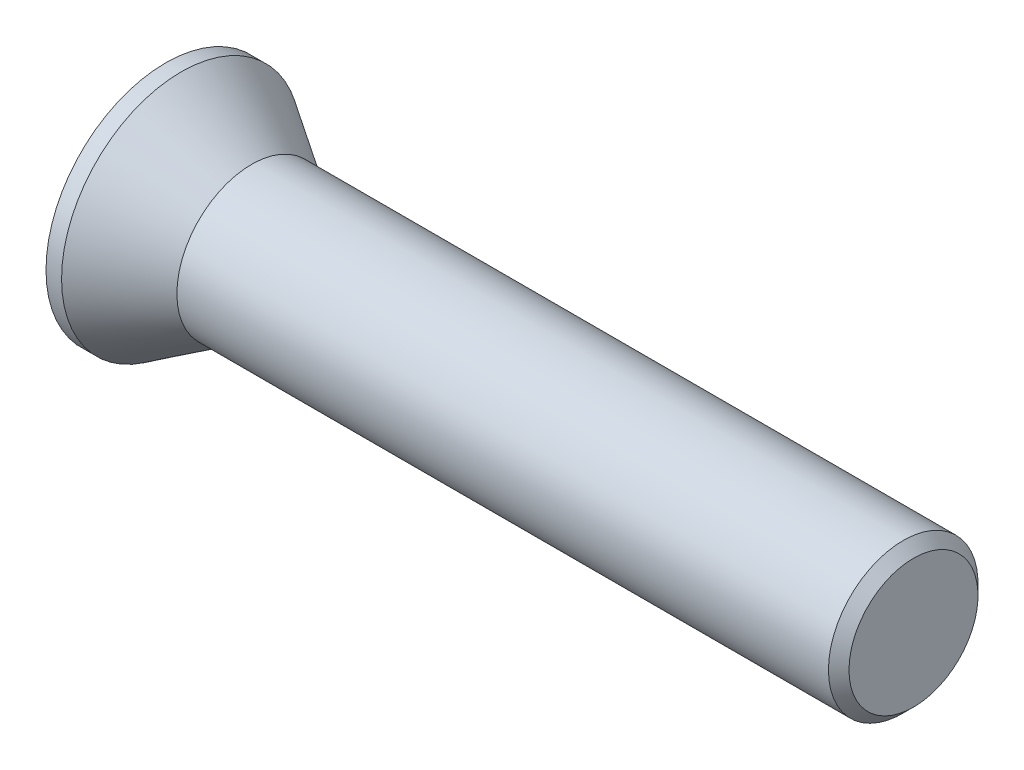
ISO-10303-21;
HEADER;
FILE_DESCRIPTION(('STEP AP214'),'2;1');
FILE_NAME('part.step','',(''),(''),'','','');
FILE_SCHEMA(('AUTOMOTIVE_DESIGN { 1 0 10303 214 1 1 1 1 }'));
ENDSEC;
DATA;
#1=APPLICATION_CONTEXT('core data for automotive mechanical design processes');
#2=APPLICATION_PROTOCOL_DEFINITION('international standard','automotive_design',2000,#1);
#3=PRODUCT_CONTEXT('',#1,'mechanical');
#4=PRODUCT('Part','Part','',(#3));
#5=PRODUCT_RELATED_PRODUCT_CATEGORY('part','',(#4));
#6=PRODUCT_DEFINITION_FORMATION('','',#4);
#7=PRODUCT_DEFINITION_CONTEXT('part definition',#1,'design');
#8=PRODUCT_DEFINITION('design','',#6,#7);
#9=PRODUCT_DEFINITION_SHAPE('','',#8);
#10=(LENGTH_UNIT() NAMED_UNIT(*) SI_UNIT(.MILLI.,.METRE.));
#11=(NAMED_UNIT(*) PLANE_ANGLE_UNIT() SI_UNIT($,.RADIAN.));
#12=(NAMED_UNIT(*) SI_UNIT($,.STERADIAN.) SOLID_ANGLE_UNIT());
#13=UNCERTAINTY_MEASURE_WITH_UNIT(LENGTH_MEASURE(1.E-05),#10,'distance_accuracy_value','');
#14=(GEOMETRIC_REPRESENTATION_CONTEXT(3) GLOBAL_UNCERTAINTY_ASSIGNED_CONTEXT((#13)) GLOBAL_UNIT_ASSIGNED_CONTEXT((#10,
#11,#12)) REPRESENTATION_CONTEXT('',''));
#15=CARTESIAN_POINT('',(0.,0.,0.));
#16=DIRECTION('',(0.,0.,1.));
#17=DIRECTION('',(1.,0.,0.));
#18=AXIS2_PLACEMENT_3D('',#15,#16,#17);
#19=CARTESIAN_POINT('',(0.,0.,0.));
#20=DIRECTION('',(-1.,0.,0.));
#21=DIRECTION('',(0.,0.,1.));
#22=AXIS2_PLACEMENT_3D('',#19,#20,#21);
#23=PLANE('',#22);
#24=CARTESIAN_POINT('',(0.,0.,0.));
#25=DIRECTION('',(-1.,0.,0.));
#26=DIRECTION('',(0.,0.,1.));
#27=AXIS2_PLACEMENT_3D('',#24,#25,#26);
#28=CIRCLE('',#27,16.);
#29=CARTESIAN_POINT('',(0.,0.,16.));
#30=VERTEX_POINT('',#29);
#31=EDGE_CURVE('E11',#30,#30,#28,.T.);
#32=ORIENTED_EDGE('',*,*,#31,.T.);
#33=EDGE_LOOP('',(#32));
#34=FACE_BOUND('',#33,.T.);
#35=DIRECTION('',(0.,1.,0.));
#36=VECTOR('',#35,1.);
#37=CARTESIAN_POINT('',(0.,-2.5,12.5));
#38=LINE('',#37,#36);
#39=CARTESIAN_POINT('',(0.,-2.5,12.5));
#40=VERTEX_POINT('',#39);
#41=CARTESIAN_POINT('',(0.,2.5,12.5));
#42=VERTEX_POINT('',#41);
#43=EDGE_CURVE('E85',#40,#42,#38,.T.);
#44=ORIENTED_EDGE('',*,*,#43,.F.);
#45=DIRECTION('',(0.,0.,1.));
#46=VECTOR('',#45,1.);
#47=CARTESIAN_POINT('',(0.,-2.5,-12.5));
#48=LINE('',#47,#46);
#49=CARTESIAN_POINT('',(0.,-2.5,-12.5));
#50=VERTEX_POINT('',#49);
#51=EDGE_CURVE('E95',#50,#40,#48,.T.);
#52=ORIENTED_EDGE('',*,*,#51,.F.);
#53=DIRECTION('',(0.,1.,0.));
#54=VECTOR('',#53,1.);
#55=CARTESIAN_POINT('',(0.,-2.5,-12.5));
#56=LINE('',#55,#54);
#57=CARTESIAN_POINT('',(0.,2.5,-12.5));
#58=VERTEX_POINT('',#57);
#59=EDGE_CURVE('E55',#50,#58,#56,.T.);
#60=ORIENTED_EDGE('',*,*,#59,.T.);
#61=DIRECTION('',(0.,0.,1.));
#62=VECTOR('',#61,1.);
#63=CARTESIAN_POINT('',(0.,2.5,-12.5));
#64=LINE('',#63,#62);
#65=EDGE_CURVE('E90',#58,#42,#64,.T.);
#66=ORIENTED_EDGE('',*,*,#65,.T.);
#67=EDGE_LOOP('',(#44,#52,#60,#66));
#68=FACE_BOUND('',#67,.T.);
#69=ADVANCED_FACE('F33',(#34,#68),#23,.T.);
#70=CARTESIAN_POINT('',(0.,0.,0.));
#71=DIRECTION('',(-1.,0.,0.));
#72=DIRECTION('',(0.,0.,1.));
#73=AXIS2_PLACEMENT_3D('',#70,#71,#72);
#74=CYLINDRICAL_SURFACE('',#73,16.);
#75=CARTESIAN_POINT('',(2.08188653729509,0.,0.));
#76=DIRECTION('',(-1.,0.,0.));
#77=DIRECTION('',(0.,0.,1.));
#78=AXIS2_PLACEMENT_3D('',#75,#76,#77);
#79=CIRCLE('',#78,16.);
#80=CARTESIAN_POINT('',(2.08188653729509,0.,16.));
#81=VERTEX_POINT('',#80);
#82=EDGE_CURVE('E40',#81,#81,#79,.T.);
#83=ORIENTED_EDGE('',*,*,#82,.T.);
#84=EDGE_LOOP('',(#83));
#85=FACE_BOUND('',#84,.T.);
#86=ORIENTED_EDGE('',*,*,#31,.F.);
#87=EDGE_LOOP('',(#86));
#88=FACE_BOUND('',#87,.T.);
#89=ADVANCED_FACE('F120',(#85,#88),#74,.T.);
#90=CARTESIAN_POINT('',(2.08188653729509,0.,0.));
#91=DIRECTION('',(-1.,0.,0.));
#92=DIRECTION('',(0.,0.,1.));
#93=AXIS2_PLACEMENT_3D('',#90,#91,#92);
#94=CONICAL_SURFACE('',#93,16.,0.567232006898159);
#95=CARTESIAN_POINT('',(11.5,0.,0.));
#96=DIRECTION('',(-1.,0.,0.));
#97=DIRECTION('',(0.,0.,1.));
#98=AXIS2_PLACEMENT_3D('',#95,#96,#97);
#99=CIRCLE('',#98,10.);
#100=CARTESIAN_POINT('',(11.5,0.,10.));
#101=VERTEX_POINT('',#100);
#102=EDGE_CURVE('E115',#101,#101,#99,.T.);
#103=ORIENTED_EDGE('',*,*,#102,.T.);
#104=EDGE_LOOP('',(#103));
#105=FACE_BOUND('',#104,.T.);
#106=ORIENTED_EDGE('',*,*,#82,.F.);
#107=EDGE_LOOP('',(#106));
#108=FACE_BOUND('',#107,.T.);
#109=ADVANCED_FACE('F123',(#105,#108),#94,.T.);
#110=CARTESIAN_POINT('',(0.,0.,0.));
#111=DIRECTION('',(-1.,0.,0.));
#112=DIRECTION('',(0.,0.,1.));
#113=AXIS2_PLACEMENT_3D('',#110,#111,#112);
#114=CYLINDRICAL_SURFACE('',#113,10.);
#115=CARTESIAN_POINT('',(98.6259999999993,0.,0.));
#116=DIRECTION('',(-1.,0.,0.));
#117=DIRECTION('',(0.,0.,1.));
#118=AXIS2_PLACEMENT_3D('',#115,#116,#117);
#119=CIRCLE('',#118,10.);
#120=CARTESIAN_POINT('',(98.6259999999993,0.,10.));
#121=VERTEX_POINT('',#120);
#122=EDGE_CURVE('E112',#121,#121,#119,.T.);
#123=ORIENTED_EDGE('',*,*,#122,.T.);
#124=EDGE_LOOP('',(#123));
#125=FACE_BOUND('',#124,.T.);
#126=ORIENTED_EDGE('',*,*,#102,.F.);
#127=EDGE_LOOP('',(#126));
#128=FACE_BOUND('',#127,.T.);
#129=ADVANCED_FACE('F125',(#125,#128),#114,.T.);
#130=CARTESIAN_POINT('',(100.,0.,0.));
#131=DIRECTION('',(-1.,0.,0.));
#132=DIRECTION('',(0.,0.,1.));
#133=AXIS2_PLACEMENT_3D('',#130,#131,#132);
#134=CONICAL_SURFACE('',#133,8.626,0.785398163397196);
#135=ORIENTED_EDGE('',*,*,#122,.F.);
#136=EDGE_LOOP('',(#135));
#137=FACE_BOUND('',#136,.T.);
#138=CARTESIAN_POINT('',(100.,0.,0.));
#139=DIRECTION('',(-1.,0.,0.));
#140=DIRECTION('',(0.,0.,1.));
#141=AXIS2_PLACEMENT_3D('',#138,#139,#140);
#142=CIRCLE('',#141,8.626);
#143=CARTESIAN_POINT('',(100.,0.,8.626));
#144=VERTEX_POINT('',#143);
#145=EDGE_CURVE('E107',#144,#144,#142,.T.);
#146=ORIENTED_EDGE('',*,*,#145,.T.);
#147=EDGE_LOOP('',(#146));
#148=FACE_BOUND('',#147,.T.);
#149=ADVANCED_FACE('F132',(#137,#148),#134,.T.);
#150=CARTESIAN_POINT('',(100.,8.626,0.));
#151=DIRECTION('',(1.,0.,0.));
#152=DIRECTION('',(0.,0.,-1.));
#153=AXIS2_PLACEMENT_3D('',#150,#151,#152);
#154=PLANE('',#153);
#155=ORIENTED_EDGE('',*,*,#145,.F.);
#156=EDGE_LOOP('',(#155));
#157=FACE_BOUND('',#156,.T.);
#158=ADVANCED_FACE('F146',(#157),#154,.T.);
#159=CARTESIAN_POINT('',(0.,-2.5,-12.5));
#160=DIRECTION('',(0.537299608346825,0.,-0.843391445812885));
#161=DIRECTION('',(-0.843391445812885,0.,-0.537299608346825));
#162=AXIS2_PLACEMENT_3D('',#159,#160,#161);
#163=PLANE('',#162);
#164=ORIENTED_EDGE('',*,*,#59,.F.);
#165=DIRECTION('',(-0.843391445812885,0.,-0.537299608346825));
#166=VECTOR('',#165,1.);
#167=CARTESIAN_POINT('',(0.,-2.5,-12.5));
#168=LINE('',#167,#166);
#169=CARTESIAN_POINT('',(4.,-2.5,-9.95171895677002));
#170=VERTEX_POINT('',#169);
#171=EDGE_CURVE('E104',#170,#50,#168,.T.);
#172=ORIENTED_EDGE('',*,*,#171,.F.);
#173=DIRECTION('',(0.,1.,0.));
#174=VECTOR('',#173,1.);
#175=CARTESIAN_POINT('',(4.,-2.5,-9.95171895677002));
#176=LINE('',#175,#174);
#177=CARTESIAN_POINT('',(4.,2.5,-9.95171895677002));
#178=VERTEX_POINT('',#177);
#179=EDGE_CURVE('E84',#170,#178,#176,.T.);
#180=ORIENTED_EDGE('',*,*,#179,.T.);
#181=DIRECTION('',(-0.843391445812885,0.,-0.537299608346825));
#182=VECTOR('',#181,1.);
#183=CARTESIAN_POINT('',(0.,2.5,-12.5));
#184=LINE('',#183,#182);
#185=EDGE_CURVE('E93',#178,#58,#184,.T.);
#186=ORIENTED_EDGE('',*,*,#185,.T.);
#187=EDGE_LOOP('',(#164,#172,#180,#186));
#188=FACE_BOUND('',#187,.T.);
#189=ADVANCED_FACE('F144',(#188),#163,.F.);
#190=CARTESIAN_POINT('',(4.,-2.5,-9.95171895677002));
#191=DIRECTION('',(1.,0.,0.));
#192=DIRECTION('',(0.,0.,-1.));
#193=AXIS2_PLACEMENT_3D('',#190,#191,#192);
#194=PLANE('',#193);
#195=ORIENTED_EDGE('',*,*,#179,.F.);
#196=DIRECTION('',(0.,0.,-1.));
#197=VECTOR('',#196,1.);
#198=CARTESIAN_POINT('',(4.,-2.5,-9.95171895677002));
#199=LINE('',#198,#197);
#200=CARTESIAN_POINT('',(4.,-2.5,9.95171895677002));
#201=VERTEX_POINT('',#200);
#202=EDGE_CURVE('E81',#201,#170,#199,.T.);
#203=ORIENTED_EDGE('',*,*,#202,.F.);
#204=DIRECTION('',(0.,1.,0.));
#205=VECTOR('',#204,1.);
#206=CARTESIAN_POINT('',(4.,-2.5,9.95171895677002));
#207=LINE('',#206,#205);
#208=CARTESIAN_POINT('',(4.,2.5,9.95171895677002));
#209=VERTEX_POINT('',#208);
#210=EDGE_CURVE('E76',#201,#209,#207,.T.);
#211=ORIENTED_EDGE('',*,*,#210,.T.);
#212=DIRECTION('',(0.,0.,-1.));
#213=VECTOR('',#212,1.);
#214=CARTESIAN_POINT('',(4.,2.5,-9.95171895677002));
#215=LINE('',#214,#213);
#216=EDGE_CURVE('E78',#209,#178,#215,.T.);
#217=ORIENTED_EDGE('',*,*,#216,.T.);
#218=EDGE_LOOP('',(#195,#203,#211,#217));
#219=FACE_BOUND('',#218,.T.);
#220=ADVANCED_FACE('F77',(#219),#194,.F.);
#221=CARTESIAN_POINT('',(0.,-2.5,12.5));
#222=DIRECTION('',(0.537299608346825,0.,0.843391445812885));
#223=DIRECTION('',(0.843391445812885,0.,-0.537299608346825));
#224=AXIS2_PLACEMENT_3D('',#221,#222,#223);
#225=PLANE('',#224);
#226=ORIENTED_EDGE('',*,*,#210,.F.);
#227=DIRECTION('',(0.843391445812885,0.,-0.537299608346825));
#228=VECTOR('',#227,1.);
#229=CARTESIAN_POINT('',(0.,-2.5,12.5));
#230=LINE('',#229,#228);
#231=EDGE_CURVE('E101',#40,#201,#230,.T.);
#232=ORIENTED_EDGE('',*,*,#231,.F.);
#233=ORIENTED_EDGE('',*,*,#43,.T.);
#234=DIRECTION('',(0.843391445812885,0.,-0.537299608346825));
#235=VECTOR('',#234,1.);
#236=CARTESIAN_POINT('',(0.,2.5,12.5));
#237=LINE('',#236,#235);
#238=EDGE_CURVE('E47',#42,#209,#237,.T.);
#239=ORIENTED_EDGE('',*,*,#238,.T.);
#240=EDGE_LOOP('',(#226,#232,#233,#239));
#241=FACE_BOUND('',#240,.T.);
#242=ADVANCED_FACE('F87',(#241),#225,.F.);
#243=CARTESIAN_POINT('',(0.,-2.5,12.5));
#244=DIRECTION('',(0.,1.,0.));
#245=DIRECTION('',(0.,0.,1.));
#246=AXIS2_PLACEMENT_3D('',#243,#244,#245);
#247=PLANE('',#246);
#248=ORIENTED_EDGE('',*,*,#51,.T.);
#249=ORIENTED_EDGE('',*,*,#231,.T.);
#250=ORIENTED_EDGE('',*,*,#202,.T.);
#251=ORIENTED_EDGE('',*,*,#171,.T.);
#252=EDGE_LOOP('',(#248,#249,#250,#251));
#253=FACE_BOUND('',#252,.T.);
#254=ADVANCED_FACE('F143',(#253),#247,.T.);
#255=CARTESIAN_POINT('',(0.,2.5,12.5));
#256=DIRECTION('',(0.,1.,0.));
#257=DIRECTION('',(0.,0.,1.));
#258=AXIS2_PLACEMENT_3D('',#255,#256,#257);
#259=PLANE('',#258);
#260=ORIENTED_EDGE('',*,*,#65,.F.);
#261=ORIENTED_EDGE('',*,*,#185,.F.);
#262=ORIENTED_EDGE('',*,*,#216,.F.);
#263=ORIENTED_EDGE('',*,*,#238,.F.);
#264=EDGE_LOOP('',(#260,#261,#262,#263));
#265=FACE_BOUND('',#264,.T.);
#266=ADVANCED_FACE('F92',(#265),#259,.F.);
#267=CLOSED_SHELL('',(#69,#89,#109,#129,#149,#158,#189,#220,#242,#254,#266));
#268=MANIFOLD_SOLID_BREP('B2',#267);
#269=ADVANCED_BREP_SHAPE_REPRESENTATION('',(#18,#268),#14);
#270=SHAPE_DEFINITION_REPRESENTATION(#9,#269);
ENDSEC;
END-ISO-10303-21;
